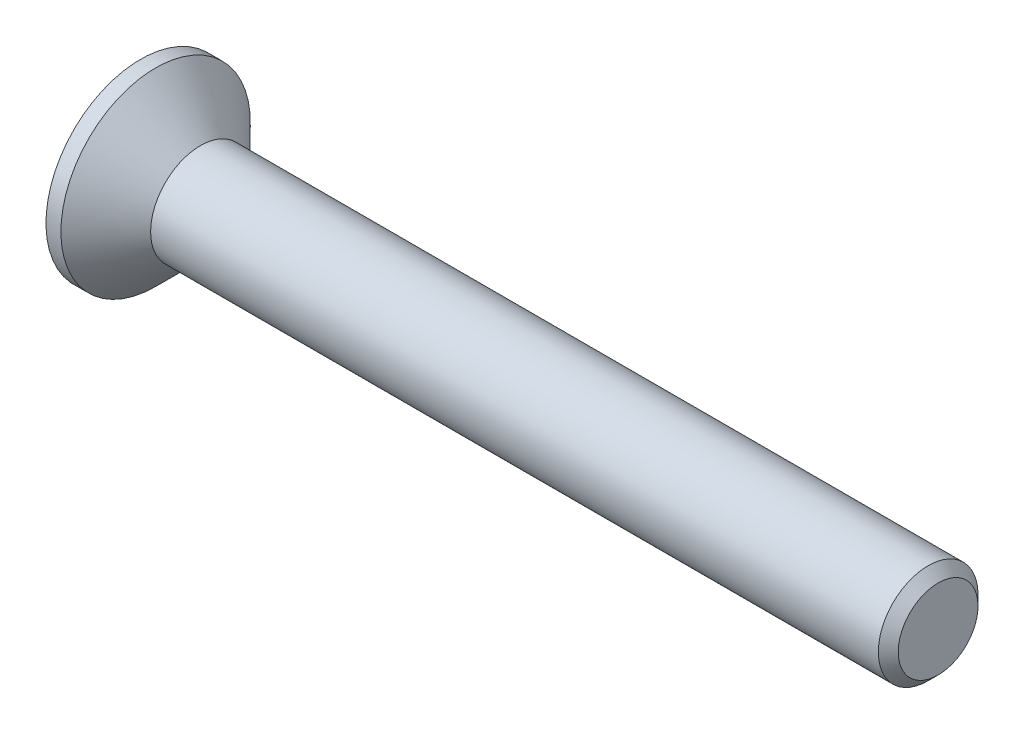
ISO-10303-21;
HEADER;
FILE_DESCRIPTION(('STEP AP214'),'2;1');
FILE_NAME('part.step','',(''),(''),'','','');
FILE_SCHEMA(('AUTOMOTIVE_DESIGN { 1 0 10303 214 1 1 1 1 }'));
ENDSEC;
DATA;
#1=APPLICATION_CONTEXT('core data for automotive mechanical design processes');
#2=APPLICATION_PROTOCOL_DEFINITION('international standard','automotive_design',2000,#1);
#3=PRODUCT_CONTEXT('',#1,'mechanical');
#4=PRODUCT('Part','Part','',(#3));
#5=PRODUCT_RELATED_PRODUCT_CATEGORY('part','',(#4));
#6=PRODUCT_DEFINITION_FORMATION('','',#4);
#7=PRODUCT_DEFINITION_CONTEXT('part definition',#1,'design');
#8=PRODUCT_DEFINITION('design','',#6,#7);
#9=PRODUCT_DEFINITION_SHAPE('','',#8);
#10=(LENGTH_UNIT() NAMED_UNIT(*) SI_UNIT(.MILLI.,.METRE.));
#11=(NAMED_UNIT(*) PLANE_ANGLE_UNIT() SI_UNIT($,.RADIAN.));
#12=(NAMED_UNIT(*) SI_UNIT($,.STERADIAN.) SOLID_ANGLE_UNIT());
#13=UNCERTAINTY_MEASURE_WITH_UNIT(LENGTH_MEASURE(1.E-05),#10,'distance_accuracy_value','');
#14=(GEOMETRIC_REPRESENTATION_CONTEXT(3) GLOBAL_UNCERTAINTY_ASSIGNED_CONTEXT((#13)) GLOBAL_UNIT_ASSIGNED_CONTEXT((#10,
#11,#12)) REPRESENTATION_CONTEXT('',''));
#15=CARTESIAN_POINT('',(0.,0.,0.));
#16=DIRECTION('',(0.,0.,1.));
#17=DIRECTION('',(1.,0.,0.));
#18=AXIS2_PLACEMENT_3D('',#15,#16,#17);
#19=CARTESIAN_POINT('',(0.,0.,0.));
#20=DIRECTION('',(-1.,0.,0.));
#21=DIRECTION('',(0.,-1.,0.));
#22=AXIS2_PLACEMENT_3D('',#19,#20,#21);
#23=CONICAL_SURFACE('',#22,1.,0.78539816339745);
#24=CARTESIAN_POINT('',(-0.899999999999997,0.,0.));
#25=DIRECTION('',(-1.,0.,0.));
#26=DIRECTION('',(0.,-1.,0.));
#27=AXIS2_PLACEMENT_3D('',#24,#25,#26);
#28=CIRCLE('',#27,1.9);
#29=CARTESIAN_POINT('',(-0.899999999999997,-1.9,0.));
#30=VERTEX_POINT('',#29);
#31=EDGE_CURVE('E189',#30,#30,#28,.T.);
#32=ORIENTED_EDGE('',*,*,#31,.F.);
#33=EDGE_LOOP('',(#32));
#34=FACE_BOUND('',#33,.T.);
#35=CARTESIAN_POINT('',(0.,0.,0.));
#36=DIRECTION('',(-1.,0.,0.));
#37=DIRECTION('',(0.,-1.,0.));
#38=AXIS2_PLACEMENT_3D('',#35,#36,#37);
#39=CIRCLE('',#38,1.);
#40=CARTESIAN_POINT('',(0.,-1.,0.));
#41=VERTEX_POINT('',#40);
#42=EDGE_CURVE('E212',#41,#41,#39,.T.);
#43=ORIENTED_EDGE('',*,*,#42,.T.);
#44=EDGE_LOOP('',(#43));
#45=FACE_BOUND('',#44,.T.);
#46=ADVANCED_FACE('F33',(#34,#45),#23,.T.);
#47=CARTESIAN_POINT('',(-1.2,0.,0.));
#48=DIRECTION('',(-1.,0.,0.));
#49=DIRECTION('',(0.,-1.,0.));
#50=AXIS2_PLACEMENT_3D('',#47,#48,#49);
#51=CYLINDRICAL_SURFACE('',#50,1.);
#52=CARTESIAN_POINT('',(14.6,0.,0.));
#53=DIRECTION('',(-1.,0.,0.));
#54=DIRECTION('',(0.,-1.,0.));
#55=AXIS2_PLACEMENT_3D('',#52,#53,#54);
#56=CIRCLE('',#55,1.);
#57=CARTESIAN_POINT('',(14.6,-1.,0.));
#58=VERTEX_POINT('',#57);
#59=EDGE_CURVE('E41',#58,#58,#56,.T.);
#60=ORIENTED_EDGE('',*,*,#59,.T.);
#61=EDGE_LOOP('',(#60));
#62=FACE_BOUND('',#61,.T.);
#63=ORIENTED_EDGE('',*,*,#42,.F.);
#64=EDGE_LOOP('',(#63));
#65=FACE_BOUND('',#64,.T.);
#66=ADVANCED_FACE('F217',(#62,#65),#51,.T.);
#67=CARTESIAN_POINT('',(14.8,0.,0.));
#68=DIRECTION('',(-1.,0.,0.));
#69=DIRECTION('',(0.,-1.,0.));
#70=AXIS2_PLACEMENT_3D('',#67,#68,#69);
#71=PLANE('',#70);
#72=CARTESIAN_POINT('',(14.8,0.,0.));
#73=DIRECTION('',(-1.,0.,0.));
#74=DIRECTION('',(0.,-1.,0.));
#75=AXIS2_PLACEMENT_3D('',#72,#73,#74);
#76=CIRCLE('',#75,0.8);
#77=CARTESIAN_POINT('',(14.8,-0.8,0.));
#78=VERTEX_POINT('',#77);
#79=EDGE_CURVE('E11',#78,#78,#76,.F.);
#80=ORIENTED_EDGE('',*,*,#79,.T.);
#81=EDGE_LOOP('',(#80));
#82=FACE_BOUND('',#81,.T.);
#83=ADVANCED_FACE('F239',(#82),#71,.F.);
#84=CARTESIAN_POINT('',(-1.2,1.9,0.));
#85=DIRECTION('',(1.,0.,0.));
#86=DIRECTION('',(0.,1.,0.));
#87=AXIS2_PLACEMENT_3D('',#84,#85,#86);
#88=PLANE('',#87);
#89=DIRECTION('',(0.,0.,-1.));
#90=VECTOR('',#89,1.);
#91=CARTESIAN_POINT('',(-1.2,0.3,-1.175));
#92=LINE('',#91,#90);
#93=CARTESIAN_POINT('',(-1.2,0.3,-0.3));
#94=VERTEX_POINT('',#93);
#95=CARTESIAN_POINT('',(-1.2,0.3,-1.175));
#96=VERTEX_POINT('',#95);
#97=EDGE_CURVE('E158',#94,#96,#92,.T.);
#98=ORIENTED_EDGE('',*,*,#97,.F.);
#99=DIRECTION('',(0.,-1.,0.));
#100=VECTOR('',#99,1.);
#101=CARTESIAN_POINT('',(-1.2,0.3,-0.3));
#102=LINE('',#101,#100);
#103=CARTESIAN_POINT('',(-1.2,1.175,-0.3));
#104=VERTEX_POINT('',#103);
#105=EDGE_CURVE('E48',#104,#94,#102,.T.);
#106=ORIENTED_EDGE('',*,*,#105,.F.);
#107=DIRECTION('',(0.,0.,-1.));
#108=VECTOR('',#107,1.);
#109=CARTESIAN_POINT('',(-1.2,1.175,-0.3));
#110=LINE('',#109,#108);
#111=CARTESIAN_POINT('',(-1.2,1.175,0.3));
#112=VERTEX_POINT('',#111);
#113=EDGE_CURVE('E185',#112,#104,#110,.T.);
#114=ORIENTED_EDGE('',*,*,#113,.F.);
#115=DIRECTION('',(0.,1.,0.));
#116=VECTOR('',#115,1.);
#117=CARTESIAN_POINT('',(-1.2,1.175,0.3));
#118=LINE('',#117,#116);
#119=CARTESIAN_POINT('',(-1.2,0.3,0.3));
#120=VERTEX_POINT('',#119);
#121=EDGE_CURVE('E183',#120,#112,#118,.T.);
#122=ORIENTED_EDGE('',*,*,#121,.F.);
#123=DIRECTION('',(0.,0.,-1.));
#124=VECTOR('',#123,1.);
#125=CARTESIAN_POINT('',(-1.2,0.3,0.3));
#126=LINE('',#125,#124);
#127=CARTESIAN_POINT('',(-1.2,0.3,1.175));
#128=VERTEX_POINT('',#127);
#129=EDGE_CURVE('E132',#128,#120,#126,.T.);
#130=ORIENTED_EDGE('',*,*,#129,.F.);
#131=DIRECTION('',(0.,1.,0.));
#132=VECTOR('',#131,1.);
#133=CARTESIAN_POINT('',(-1.2,0.3,1.175));
#134=LINE('',#133,#132);
#135=CARTESIAN_POINT('',(-1.2,-0.3,1.175));
#136=VERTEX_POINT('',#135);
#137=EDGE_CURVE('E179',#136,#128,#134,.T.);
#138=ORIENTED_EDGE('',*,*,#137,.F.);
#139=DIRECTION('',(0.,0.,1.));
#140=VECTOR('',#139,1.);
#141=CARTESIAN_POINT('',(-1.2,-0.3,1.175));
#142=LINE('',#141,#140);
#143=CARTESIAN_POINT('',(-1.2,-0.3,0.3));
#144=VERTEX_POINT('',#143);
#145=EDGE_CURVE('E176',#144,#136,#142,.T.);
#146=ORIENTED_EDGE('',*,*,#145,.F.);
#147=DIRECTION('',(0.,1.,0.));
#148=VECTOR('',#147,1.);
#149=CARTESIAN_POINT('',(-1.2,-0.3,0.3));
#150=LINE('',#149,#148);
#151=CARTESIAN_POINT('',(-1.2,-1.175,0.3));
#152=VERTEX_POINT('',#151);
#153=EDGE_CURVE('E173',#152,#144,#150,.T.);
#154=ORIENTED_EDGE('',*,*,#153,.F.);
#155=DIRECTION('',(0.,0.,1.));
#156=VECTOR('',#155,1.);
#157=CARTESIAN_POINT('',(-1.2,-1.175,0.3));
#158=LINE('',#157,#156);
#159=CARTESIAN_POINT('',(-1.2,-1.175,-0.3));
#160=VERTEX_POINT('',#159);
#161=EDGE_CURVE('E170',#160,#152,#158,.T.);
#162=ORIENTED_EDGE('',*,*,#161,.F.);
#163=DIRECTION('',(0.,-1.,0.));
#164=VECTOR('',#163,1.);
#165=CARTESIAN_POINT('',(-1.2,-1.175,-0.3));
#166=LINE('',#165,#164);
#167=CARTESIAN_POINT('',(-1.2,-0.3,-0.3));
#168=VERTEX_POINT('',#167);
#169=EDGE_CURVE('E167',#168,#160,#166,.T.);
#170=ORIENTED_EDGE('',*,*,#169,.F.);
#171=DIRECTION('',(0.,0.,1.));
#172=VECTOR('',#171,1.);
#173=CARTESIAN_POINT('',(-1.2,-0.3,-0.3));
#174=LINE('',#173,#172);
#175=CARTESIAN_POINT('',(-1.2,-0.3,-1.175));
#176=VERTEX_POINT('',#175);
#177=EDGE_CURVE('E164',#176,#168,#174,.T.);
#178=ORIENTED_EDGE('',*,*,#177,.F.);
#179=DIRECTION('',(0.,-1.,0.));
#180=VECTOR('',#179,1.);
#181=CARTESIAN_POINT('',(-1.2,-0.3,-1.175));
#182=LINE('',#181,#180);
#183=EDGE_CURVE('E161',#96,#176,#182,.T.);
#184=ORIENTED_EDGE('',*,*,#183,.F.);
#185=EDGE_LOOP('',(#98,#106,#114,#122,#130,#138,#146,#154,#162,#170,#178,#184));
#186=FACE_BOUND('',#185,.T.);
#187=CARTESIAN_POINT('',(-1.2,0.,0.));
#188=DIRECTION('',(-1.,0.,0.));
#189=DIRECTION('',(0.,-1.,0.));
#190=AXIS2_PLACEMENT_3D('',#187,#188,#189);
#191=CIRCLE('',#190,1.9);
#192=CARTESIAN_POINT('',(-1.2,-1.9,0.));
#193=VERTEX_POINT('',#192);
#194=EDGE_CURVE('E209',#193,#193,#191,.T.);
#195=ORIENTED_EDGE('',*,*,#194,.T.);
#196=EDGE_LOOP('',(#195));
#197=FACE_BOUND('',#196,.T.);
#198=ADVANCED_FACE('F230',(#186,#197),#88,.F.);
#199=CARTESIAN_POINT('',(-1.2,0.,0.));
#200=DIRECTION('',(-1.,0.,0.));
#201=DIRECTION('',(0.,-1.,0.));
#202=AXIS2_PLACEMENT_3D('',#199,#200,#201);
#203=CYLINDRICAL_SURFACE('',#202,1.9);
#204=ORIENTED_EDGE('',*,*,#194,.F.);
#205=EDGE_LOOP('',(#204));
#206=FACE_BOUND('',#205,.T.);
#207=ORIENTED_EDGE('',*,*,#31,.T.);
#208=EDGE_LOOP('',(#207));
#209=FACE_BOUND('',#208,.T.);
#210=ADVANCED_FACE('F222',(#206,#209),#203,.T.);
#211=CARTESIAN_POINT('',(14.6,0.,0.));
#212=DIRECTION('',(-1.,0.,0.));
#213=DIRECTION('',(0.,-1.,0.));
#214=AXIS2_PLACEMENT_3D('',#211,#212,#213);
#215=CONICAL_SURFACE('',#214,1.,0.785398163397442);
#216=ORIENTED_EDGE('',*,*,#79,.F.);
#217=EDGE_LOOP('',(#216));
#218=FACE_BOUND('',#217,.T.);
#219=ORIENTED_EDGE('',*,*,#59,.F.);
#220=EDGE_LOOP('',(#219));
#221=FACE_BOUND('',#220,.T.);
#222=ADVANCED_FACE('F35',(#218,#221),#215,.T.);
#223=CARTESIAN_POINT('',(-0.249999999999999,0.3,-0.3));
#224=DIRECTION('',(0.,0.,-1.));
#225=DIRECTION('',(0.,1.,0.));
#226=AXIS2_PLACEMENT_3D('',#223,#224,#225);
#227=PLANE('',#226);
#228=ORIENTED_EDGE('',*,*,#105,.T.);
#229=DIRECTION('',(-1.,0.,0.));
#230=VECTOR('',#229,1.);
#231=CARTESIAN_POINT('',(-0.249999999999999,0.3,-0.3));
#232=LINE('',#231,#230);
#233=CARTESIAN_POINT('',(-0.249999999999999,0.3,-0.3));
#234=VERTEX_POINT('',#233);
#235=EDGE_CURVE('E96',#234,#94,#232,.T.);
#236=ORIENTED_EDGE('',*,*,#235,.F.);
#237=DIRECTION('',(0.,-1.,0.));
#238=VECTOR('',#237,1.);
#239=CARTESIAN_POINT('',(-0.249999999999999,0.3,-0.3));
#240=LINE('',#239,#238);
#241=CARTESIAN_POINT('',(-0.249999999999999,1.175,-0.3));
#242=VERTEX_POINT('',#241);
#243=EDGE_CURVE('E187',#242,#234,#240,.T.);
#244=ORIENTED_EDGE('',*,*,#243,.F.);
#245=DIRECTION('',(-1.,0.,0.));
#246=VECTOR('',#245,1.);
#247=CARTESIAN_POINT('',(-0.249999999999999,1.175,-0.3));
#248=LINE('',#247,#246);
#249=EDGE_CURVE('E56',#242,#104,#248,.T.);
#250=ORIENTED_EDGE('',*,*,#249,.T.);
#251=EDGE_LOOP('',(#228,#236,#244,#250));
#252=FACE_BOUND('',#251,.T.);
#253=ADVANCED_FACE('F221',(#252),#227,.F.);
#254=CARTESIAN_POINT('',(-0.249999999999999,1.175,-0.3));
#255=DIRECTION('',(0.,1.,0.));
#256=DIRECTION('',(-1.,0.,0.));
#257=AXIS2_PLACEMENT_3D('',#254,#255,#256);
#258=PLANE('',#257);
#259=ORIENTED_EDGE('',*,*,#113,.T.);
#260=ORIENTED_EDGE('',*,*,#249,.F.);
#261=DIRECTION('',(0.,0.,-1.));
#262=VECTOR('',#261,1.);
#263=CARTESIAN_POINT('',(-0.249999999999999,1.175,-0.3));
#264=LINE('',#263,#262);
#265=CARTESIAN_POINT('',(-0.249999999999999,1.175,0.3));
#266=VERTEX_POINT('',#265);
#267=EDGE_CURVE('E144',#266,#242,#264,.T.);
#268=ORIENTED_EDGE('',*,*,#267,.F.);
#269=DIRECTION('',(-1.,0.,0.));
#270=VECTOR('',#269,1.);
#271=CARTESIAN_POINT('',(-0.249999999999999,1.175,0.3));
#272=LINE('',#271,#270);
#273=EDGE_CURVE('E136',#266,#112,#272,.T.);
#274=ORIENTED_EDGE('',*,*,#273,.T.);
#275=EDGE_LOOP('',(#259,#260,#268,#274));
#276=FACE_BOUND('',#275,.T.);
#277=ADVANCED_FACE('F228',(#276),#258,.F.);
#278=CARTESIAN_POINT('',(-0.249999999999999,1.175,0.3));
#279=DIRECTION('',(0.,0.,1.));
#280=DIRECTION('',(0.,-1.,0.));
#281=AXIS2_PLACEMENT_3D('',#278,#279,#280);
#282=PLANE('',#281);
#283=ORIENTED_EDGE('',*,*,#121,.T.);
#284=ORIENTED_EDGE('',*,*,#273,.F.);
#285=DIRECTION('',(0.,1.,0.));
#286=VECTOR('',#285,1.);
#287=CARTESIAN_POINT('',(-0.249999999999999,1.175,0.3));
#288=LINE('',#287,#286);
#289=CARTESIAN_POINT('',(-0.249999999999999,0.3,0.3));
#290=VERTEX_POINT('',#289);
#291=EDGE_CURVE('E140',#290,#266,#288,.T.);
#292=ORIENTED_EDGE('',*,*,#291,.F.);
#293=DIRECTION('',(-1.,0.,0.));
#294=VECTOR('',#293,1.);
#295=CARTESIAN_POINT('',(-0.249999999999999,0.3,0.3));
#296=LINE('',#295,#294);
#297=EDGE_CURVE('E125',#290,#120,#296,.T.);
#298=ORIENTED_EDGE('',*,*,#297,.T.);
#299=EDGE_LOOP('',(#283,#284,#292,#298));
#300=FACE_BOUND('',#299,.T.);
#301=ADVANCED_FACE('F141',(#300),#282,.F.);
#302=CARTESIAN_POINT('',(-0.249999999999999,0.3,0.3));
#303=DIRECTION('',(0.,1.,0.));
#304=DIRECTION('',(0.,0.,1.));
#305=AXIS2_PLACEMENT_3D('',#302,#303,#304);
#306=PLANE('',#305);
#307=ORIENTED_EDGE('',*,*,#129,.T.);
#308=ORIENTED_EDGE('',*,*,#297,.F.);
#309=DIRECTION('',(0.,0.,-1.));
#310=VECTOR('',#309,1.);
#311=CARTESIAN_POINT('',(-0.249999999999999,0.3,0.3));
#312=LINE('',#311,#310);
#313=CARTESIAN_POINT('',(-0.249999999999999,0.3,1.175));
#314=VERTEX_POINT('',#313);
#315=EDGE_CURVE('E129',#314,#290,#312,.T.);
#316=ORIENTED_EDGE('',*,*,#315,.F.);
#317=DIRECTION('',(-1.,0.,0.));
#318=VECTOR('',#317,1.);
#319=CARTESIAN_POINT('',(-0.249999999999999,0.3,1.175));
#320=LINE('',#319,#318);
#321=EDGE_CURVE('E137',#314,#128,#320,.T.);
#322=ORIENTED_EDGE('',*,*,#321,.T.);
#323=EDGE_LOOP('',(#307,#308,#316,#322));
#324=FACE_BOUND('',#323,.T.);
#325=ADVANCED_FACE('F127',(#324),#306,.F.);
#326=CARTESIAN_POINT('',(-0.249999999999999,0.3,1.175));
#327=DIRECTION('',(0.,0.,1.));
#328=DIRECTION('',(1.,0.,0.));
#329=AXIS2_PLACEMENT_3D('',#326,#327,#328);
#330=PLANE('',#329);
#331=ORIENTED_EDGE('',*,*,#137,.T.);
#332=ORIENTED_EDGE('',*,*,#321,.F.);
#333=DIRECTION('',(0.,1.,0.));
#334=VECTOR('',#333,1.);
#335=CARTESIAN_POINT('',(-0.249999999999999,0.3,1.175));
#336=LINE('',#335,#334);
#337=CARTESIAN_POINT('',(-0.249999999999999,-0.3,1.175));
#338=VERTEX_POINT('',#337);
#339=EDGE_CURVE('E150',#338,#314,#336,.T.);
#340=ORIENTED_EDGE('',*,*,#339,.F.);
#341=DIRECTION('',(-1.,0.,0.));
#342=VECTOR('',#341,1.);
#343=CARTESIAN_POINT('',(-0.249999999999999,-0.3,1.175));
#344=LINE('',#343,#342);
#345=EDGE_CURVE('E192',#338,#136,#344,.T.);
#346=ORIENTED_EDGE('',*,*,#345,.T.);
#347=EDGE_LOOP('',(#331,#332,#340,#346));
#348=FACE_BOUND('',#347,.T.);
#349=ADVANCED_FACE('F277',(#348),#330,.F.);
#350=CARTESIAN_POINT('',(-0.249999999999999,-0.3,1.175));
#351=DIRECTION('',(0.,-1.,0.));
#352=DIRECTION('',(0.,0.,-1.));
#353=AXIS2_PLACEMENT_3D('',#350,#351,#352);
#354=PLANE('',#353);
#355=ORIENTED_EDGE('',*,*,#145,.T.);
#356=ORIENTED_EDGE('',*,*,#345,.F.);
#357=DIRECTION('',(0.,0.,1.));
#358=VECTOR('',#357,1.);
#359=CARTESIAN_POINT('',(-0.249999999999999,-0.3,1.175));
#360=LINE('',#359,#358);
#361=CARTESIAN_POINT('',(-0.249999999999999,-0.3,0.3));
#362=VERTEX_POINT('',#361);
#363=EDGE_CURVE('E152',#362,#338,#360,.T.);
#364=ORIENTED_EDGE('',*,*,#363,.F.);
#365=DIRECTION('',(-1.,0.,0.));
#366=VECTOR('',#365,1.);
#367=CARTESIAN_POINT('',(-0.249999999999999,-0.3,0.3));
#368=LINE('',#367,#366);
#369=EDGE_CURVE('E194',#362,#144,#368,.T.);
#370=ORIENTED_EDGE('',*,*,#369,.T.);
#371=EDGE_LOOP('',(#355,#356,#364,#370));
#372=FACE_BOUND('',#371,.T.);
#373=ADVANCED_FACE('F273',(#372),#354,.F.);
#374=CARTESIAN_POINT('',(-0.249999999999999,-0.3,0.3));
#375=DIRECTION('',(0.,0.,1.));
#376=DIRECTION('',(1.,0.,0.));
#377=AXIS2_PLACEMENT_3D('',#374,#375,#376);
#378=PLANE('',#377);
#379=ORIENTED_EDGE('',*,*,#153,.T.);
#380=ORIENTED_EDGE('',*,*,#369,.F.);
#381=DIRECTION('',(0.,1.,0.));
#382=VECTOR('',#381,1.);
#383=CARTESIAN_POINT('',(-0.249999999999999,-0.3,0.3));
#384=LINE('',#383,#382);
#385=CARTESIAN_POINT('',(-0.249999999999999,-1.175,0.3));
#386=VERTEX_POINT('',#385);
#387=EDGE_CURVE('E422',#386,#362,#384,.T.);
#388=ORIENTED_EDGE('',*,*,#387,.F.);
#389=DIRECTION('',(-1.,0.,0.));
#390=VECTOR('',#389,1.);
#391=CARTESIAN_POINT('',(-0.249999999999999,-1.175,0.3));
#392=LINE('',#391,#390);
#393=EDGE_CURVE('E196',#386,#152,#392,.T.);
#394=ORIENTED_EDGE('',*,*,#393,.T.);
#395=EDGE_LOOP('',(#379,#380,#388,#394));
#396=FACE_BOUND('',#395,.T.);
#397=ADVANCED_FACE('F269',(#396),#378,.F.);
#398=CARTESIAN_POINT('',(-0.249999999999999,-1.175,0.3));
#399=DIRECTION('',(0.,-1.,0.));
#400=DIRECTION('',(1.,0.,0.));
#401=AXIS2_PLACEMENT_3D('',#398,#399,#400);
#402=PLANE('',#401);
#403=ORIENTED_EDGE('',*,*,#161,.T.);
#404=ORIENTED_EDGE('',*,*,#393,.F.);
#405=DIRECTION('',(0.,0.,1.));
#406=VECTOR('',#405,1.);
#407=CARTESIAN_POINT('',(-0.249999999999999,-1.175,0.3));
#408=LINE('',#407,#406);
#409=CARTESIAN_POINT('',(-0.249999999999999,-1.175,-0.3));
#410=VERTEX_POINT('',#409);
#411=EDGE_CURVE('E419',#410,#386,#408,.T.);
#412=ORIENTED_EDGE('',*,*,#411,.F.);
#413=DIRECTION('',(-1.,0.,0.));
#414=VECTOR('',#413,1.);
#415=CARTESIAN_POINT('',(-0.249999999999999,-1.175,-0.3));
#416=LINE('',#415,#414);
#417=EDGE_CURVE('E198',#410,#160,#416,.T.);
#418=ORIENTED_EDGE('',*,*,#417,.T.);
#419=EDGE_LOOP('',(#403,#404,#412,#418));
#420=FACE_BOUND('',#419,.T.);
#421=ADVANCED_FACE('F265',(#420),#402,.F.);
#422=CARTESIAN_POINT('',(-0.249999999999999,-1.175,-0.3));
#423=DIRECTION('',(0.,0.,-1.));
#424=DIRECTION('',(0.,1.,0.));
#425=AXIS2_PLACEMENT_3D('',#422,#423,#424);
#426=PLANE('',#425);
#427=ORIENTED_EDGE('',*,*,#169,.T.);
#428=ORIENTED_EDGE('',*,*,#417,.F.);
#429=DIRECTION('',(0.,-1.,0.));
#430=VECTOR('',#429,1.);
#431=CARTESIAN_POINT('',(-0.249999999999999,-1.175,-0.3));
#432=LINE('',#431,#430);
#433=CARTESIAN_POINT('',(-0.249999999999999,-0.3,-0.3));
#434=VERTEX_POINT('',#433);
#435=EDGE_CURVE('E416',#434,#410,#432,.T.);
#436=ORIENTED_EDGE('',*,*,#435,.F.);
#437=DIRECTION('',(-1.,0.,0.));
#438=VECTOR('',#437,1.);
#439=CARTESIAN_POINT('',(-0.249999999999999,-0.3,-0.3));
#440=LINE('',#439,#438);
#441=EDGE_CURVE('E200',#434,#168,#440,.T.);
#442=ORIENTED_EDGE('',*,*,#441,.T.);
#443=EDGE_LOOP('',(#427,#428,#436,#442));
#444=FACE_BOUND('',#443,.T.);
#445=ADVANCED_FACE('F261',(#444),#426,.F.);
#446=CARTESIAN_POINT('',(-0.249999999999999,-0.3,-0.3));
#447=DIRECTION('',(0.,-1.,0.));
#448=DIRECTION('',(0.,0.,-1.));
#449=AXIS2_PLACEMENT_3D('',#446,#447,#448);
#450=PLANE('',#449);
#451=ORIENTED_EDGE('',*,*,#177,.T.);
#452=ORIENTED_EDGE('',*,*,#441,.F.);
#453=DIRECTION('',(0.,0.,1.));
#454=VECTOR('',#453,1.);
#455=CARTESIAN_POINT('',(-0.249999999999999,-0.3,-0.3));
#456=LINE('',#455,#454);
#457=CARTESIAN_POINT('',(-0.249999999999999,-0.3,-1.175));
#458=VERTEX_POINT('',#457);
#459=EDGE_CURVE('E413',#458,#434,#456,.T.);
#460=ORIENTED_EDGE('',*,*,#459,.F.);
#461=DIRECTION('',(-1.,0.,0.));
#462=VECTOR('',#461,1.);
#463=CARTESIAN_POINT('',(-0.249999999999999,-0.3,-1.175));
#464=LINE('',#463,#462);
#465=EDGE_CURVE('E202',#458,#176,#464,.T.);
#466=ORIENTED_EDGE('',*,*,#465,.T.);
#467=EDGE_LOOP('',(#451,#452,#460,#466));
#468=FACE_BOUND('',#467,.T.);
#469=ADVANCED_FACE('F257',(#468),#450,.F.);
#470=CARTESIAN_POINT('',(-0.249999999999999,-0.3,-1.175));
#471=DIRECTION('',(0.,0.,-1.));
#472=DIRECTION('',(-1.,0.,0.));
#473=AXIS2_PLACEMENT_3D('',#470,#471,#472);
#474=PLANE('',#473);
#475=ORIENTED_EDGE('',*,*,#183,.T.);
#476=ORIENTED_EDGE('',*,*,#465,.F.);
#477=DIRECTION('',(0.,-1.,0.));
#478=VECTOR('',#477,1.);
#479=CARTESIAN_POINT('',(-0.249999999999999,-0.3,-1.175));
#480=LINE('',#479,#478);
#481=CARTESIAN_POINT('',(-0.249999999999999,0.3,-1.175));
#482=VERTEX_POINT('',#481);
#483=EDGE_CURVE('E408',#482,#458,#480,.T.);
#484=ORIENTED_EDGE('',*,*,#483,.F.);
#485=DIRECTION('',(-1.,0.,0.));
#486=VECTOR('',#485,1.);
#487=CARTESIAN_POINT('',(-0.249999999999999,0.3,-1.175));
#488=LINE('',#487,#486);
#489=EDGE_CURVE('E204',#482,#96,#488,.T.);
#490=ORIENTED_EDGE('',*,*,#489,.T.);
#491=EDGE_LOOP('',(#475,#476,#484,#490));
#492=FACE_BOUND('',#491,.T.);
#493=ADVANCED_FACE('F253',(#492),#474,.F.);
#494=CARTESIAN_POINT('',(-0.249999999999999,0.3,-1.175));
#495=DIRECTION('',(0.,1.,0.));
#496=DIRECTION('',(0.,0.,1.));
#497=AXIS2_PLACEMENT_3D('',#494,#495,#496);
#498=PLANE('',#497);
#499=ORIENTED_EDGE('',*,*,#97,.T.);
#500=ORIENTED_EDGE('',*,*,#489,.F.);
#501=DIRECTION('',(0.,0.,-1.));
#502=VECTOR('',#501,1.);
#503=CARTESIAN_POINT('',(-0.249999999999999,0.3,-1.175));
#504=LINE('',#503,#502);
#505=EDGE_CURVE('E406',#234,#482,#504,.T.);
#506=ORIENTED_EDGE('',*,*,#505,.F.);
#507=ORIENTED_EDGE('',*,*,#235,.T.);
#508=EDGE_LOOP('',(#499,#500,#506,#507));
#509=FACE_BOUND('',#508,.T.);
#510=ADVANCED_FACE('F250',(#509),#498,.F.);
#511=CARTESIAN_POINT('',(-0.249999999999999,0.,0.));
#512=DIRECTION('',(1.,0.,0.));
#513=DIRECTION('',(0.,0.,-1.));
#514=AXIS2_PLACEMENT_3D('',#511,#512,#513);
#515=PLANE('',#514);
#516=ORIENTED_EDGE('',*,*,#243,.T.);
#517=ORIENTED_EDGE('',*,*,#505,.T.);
#518=ORIENTED_EDGE('',*,*,#483,.T.);
#519=ORIENTED_EDGE('',*,*,#459,.T.);
#520=ORIENTED_EDGE('',*,*,#435,.T.);
#521=ORIENTED_EDGE('',*,*,#411,.T.);
#522=ORIENTED_EDGE('',*,*,#387,.T.);
#523=ORIENTED_EDGE('',*,*,#363,.T.);
#524=ORIENTED_EDGE('',*,*,#339,.T.);
#525=ORIENTED_EDGE('',*,*,#315,.T.);
#526=ORIENTED_EDGE('',*,*,#291,.T.);
#527=ORIENTED_EDGE('',*,*,#267,.T.);
#528=EDGE_LOOP('',(#516,#517,#518,#519,#520,#521,#522,#523,#524,#525,#526,#527));
#529=FACE_BOUND('',#528,.T.);
#530=ADVANCED_FACE('F147',(#529),#515,.F.);
#531=CLOSED_SHELL('',(#46,#66,#83,#198,#210,#222,#253,#277,#301,#325,#349,#373,#397,#421,#445,
#469,#493,#510,#530));
#532=MANIFOLD_SOLID_BREP('B2',#531);
#533=ADVANCED_BREP_SHAPE_REPRESENTATION('',(#18,#532),#14);
#534=SHAPE_DEFINITION_REPRESENTATION(#9,#533);
ENDSEC;
END-ISO-10303-21;
